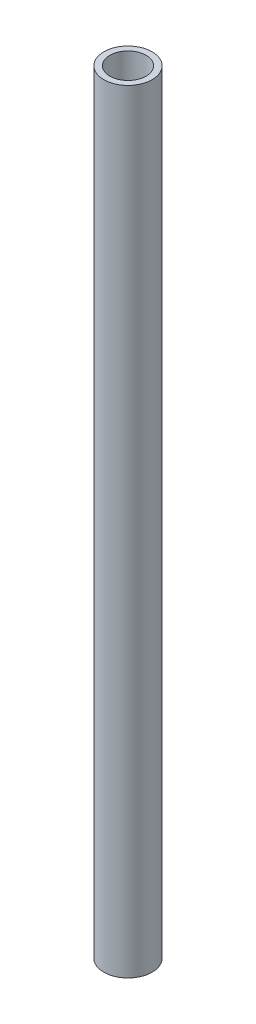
ISO-10303-21;
HEADER;
FILE_DESCRIPTION(('STEP AP214'),'2;1');
FILE_NAME('part.step','',(''),(''),'','','');
FILE_SCHEMA(('AUTOMOTIVE_DESIGN { 1 0 10303 214 1 1 1 1 }'));
ENDSEC;
DATA;
#1=APPLICATION_CONTEXT('core data for automotive mechanical design processes');
#2=APPLICATION_PROTOCOL_DEFINITION('international standard','automotive_design',2000,#1);
#3=PRODUCT_CONTEXT('',#1,'mechanical');
#4=PRODUCT('Part','Part','',(#3));
#5=PRODUCT_RELATED_PRODUCT_CATEGORY('part','',(#4));
#6=PRODUCT_DEFINITION_FORMATION('','',#4);
#7=PRODUCT_DEFINITION_CONTEXT('part definition',#1,'design');
#8=PRODUCT_DEFINITION('design','',#6,#7);
#9=PRODUCT_DEFINITION_SHAPE('','',#8);
#10=(LENGTH_UNIT() NAMED_UNIT(*) SI_UNIT(.MILLI.,.METRE.));
#11=(NAMED_UNIT(*) PLANE_ANGLE_UNIT() SI_UNIT($,.RADIAN.));
#12=(NAMED_UNIT(*) SI_UNIT($,.STERADIAN.) SOLID_ANGLE_UNIT());
#13=UNCERTAINTY_MEASURE_WITH_UNIT(LENGTH_MEASURE(1.E-05),#10,'distance_accuracy_value','');
#14=(GEOMETRIC_REPRESENTATION_CONTEXT(3) GLOBAL_UNCERTAINTY_ASSIGNED_CONTEXT((#13)) GLOBAL_UNIT_ASSIGNED_CONTEXT((#10,
#11,#12)) REPRESENTATION_CONTEXT('',''));
#15=CARTESIAN_POINT('',(0.,0.,0.));
#16=DIRECTION('',(0.,0.,1.));
#17=DIRECTION('',(1.,0.,0.));
#18=AXIS2_PLACEMENT_3D('',#15,#16,#17);
#19=CARTESIAN_POINT('',(0.,101.6,0.));
#20=DIRECTION('',(0.,1.,0.));
#21=DIRECTION('',(0.,0.,1.));
#22=AXIS2_PLACEMENT_3D('',#19,#20,#21);
#23=PLANE('',#22);
#24=CARTESIAN_POINT('',(0.,101.6,0.));
#25=DIRECTION('',(0.,1.,0.));
#26=DIRECTION('',(0.,0.,1.));
#27=AXIS2_PLACEMENT_3D('',#24,#25,#26);
#28=CIRCLE('',#27,3.175);
#29=CARTESIAN_POINT('',(0.,101.6,3.175));
#30=VERTEX_POINT('',#29);
#31=EDGE_CURVE('E10',#30,#30,#28,.T.);
#32=ORIENTED_EDGE('',*,*,#31,.T.);
#33=EDGE_LOOP('',(#32));
#34=FACE_BOUND('',#33,.T.);
#35=CARTESIAN_POINT('',(0.,101.6,0.));
#36=DIRECTION('',(0.,1.,0.));
#37=DIRECTION('',(0.,0.,1.));
#38=AXIS2_PLACEMENT_3D('',#35,#36,#37);
#39=CIRCLE('',#38,2.38125);
#40=CARTESIAN_POINT('',(0.,101.6,2.38125));
#41=VERTEX_POINT('',#40);
#42=EDGE_CURVE('E40',#41,#41,#39,.T.);
#43=ORIENTED_EDGE('',*,*,#42,.F.);
#44=EDGE_LOOP('',(#43));
#45=FACE_BOUND('',#44,.T.);
#46=ADVANCED_FACE('F29',(#34,#45),#23,.T.);
#47=CARTESIAN_POINT('',(0.,0.,0.));
#48=DIRECTION('',(0.,1.,0.));
#49=DIRECTION('',(0.,0.,1.));
#50=AXIS2_PLACEMENT_3D('',#47,#48,#49);
#51=PLANE('',#50);
#52=CARTESIAN_POINT('',(0.,0.,0.));
#53=DIRECTION('',(0.,1.,0.));
#54=DIRECTION('',(0.,0.,1.));
#55=AXIS2_PLACEMENT_3D('',#52,#53,#54);
#56=CIRCLE('',#55,3.175);
#57=CARTESIAN_POINT('',(0.,0.,3.175));
#58=VERTEX_POINT('',#57);
#59=EDGE_CURVE('E33',#58,#58,#56,.T.);
#60=ORIENTED_EDGE('',*,*,#59,.F.);
#61=EDGE_LOOP('',(#60));
#62=FACE_BOUND('',#61,.T.);
#63=CARTESIAN_POINT('',(0.,0.,0.));
#64=DIRECTION('',(0.,1.,0.));
#65=DIRECTION('',(0.,0.,1.));
#66=AXIS2_PLACEMENT_3D('',#63,#64,#65);
#67=CIRCLE('',#66,2.38125);
#68=CARTESIAN_POINT('',(0.,0.,2.38125));
#69=VERTEX_POINT('',#68);
#70=EDGE_CURVE('E42',#69,#69,#67,.T.);
#71=ORIENTED_EDGE('',*,*,#70,.T.);
#72=EDGE_LOOP('',(#71));
#73=FACE_BOUND('',#72,.T.);
#74=ADVANCED_FACE('F52',(#62,#73),#51,.F.);
#75=CARTESIAN_POINT('',(0.,101.6,0.));
#76=DIRECTION('',(0.,-1.,0.));
#77=DIRECTION('',(0.,0.,-1.));
#78=AXIS2_PLACEMENT_3D('',#75,#76,#77);
#79=CYLINDRICAL_SURFACE('',#78,3.175);
#80=ORIENTED_EDGE('',*,*,#31,.F.);
#81=EDGE_LOOP('',(#80));
#82=FACE_BOUND('',#81,.T.);
#83=ORIENTED_EDGE('',*,*,#59,.T.);
#84=EDGE_LOOP('',(#83));
#85=FACE_BOUND('',#84,.T.);
#86=ADVANCED_FACE('F31',(#82,#85),#79,.T.);
#87=CARTESIAN_POINT('',(0.,101.6,0.));
#88=DIRECTION('',(0.,-1.,0.));
#89=DIRECTION('',(0.,0.,-1.));
#90=AXIS2_PLACEMENT_3D('',#87,#88,#89);
#91=CYLINDRICAL_SURFACE('',#90,2.38125);
#92=ORIENTED_EDGE('',*,*,#42,.T.);
#93=EDGE_LOOP('',(#92));
#94=FACE_BOUND('',#93,.T.);
#95=ORIENTED_EDGE('',*,*,#70,.F.);
#96=EDGE_LOOP('',(#95));
#97=FACE_BOUND('',#96,.T.);
#98=ADVANCED_FACE('F48',(#94,#97),#91,.F.);
#99=CLOSED_SHELL('',(#46,#74,#86,#98));
#100=MANIFOLD_SOLID_BREP('B2',#99);
#101=ADVANCED_BREP_SHAPE_REPRESENTATION('',(#18,#100),#14);
#102=SHAPE_DEFINITION_REPRESENTATION(#9,#101);
ENDSEC;
END-ISO-10303-21;
